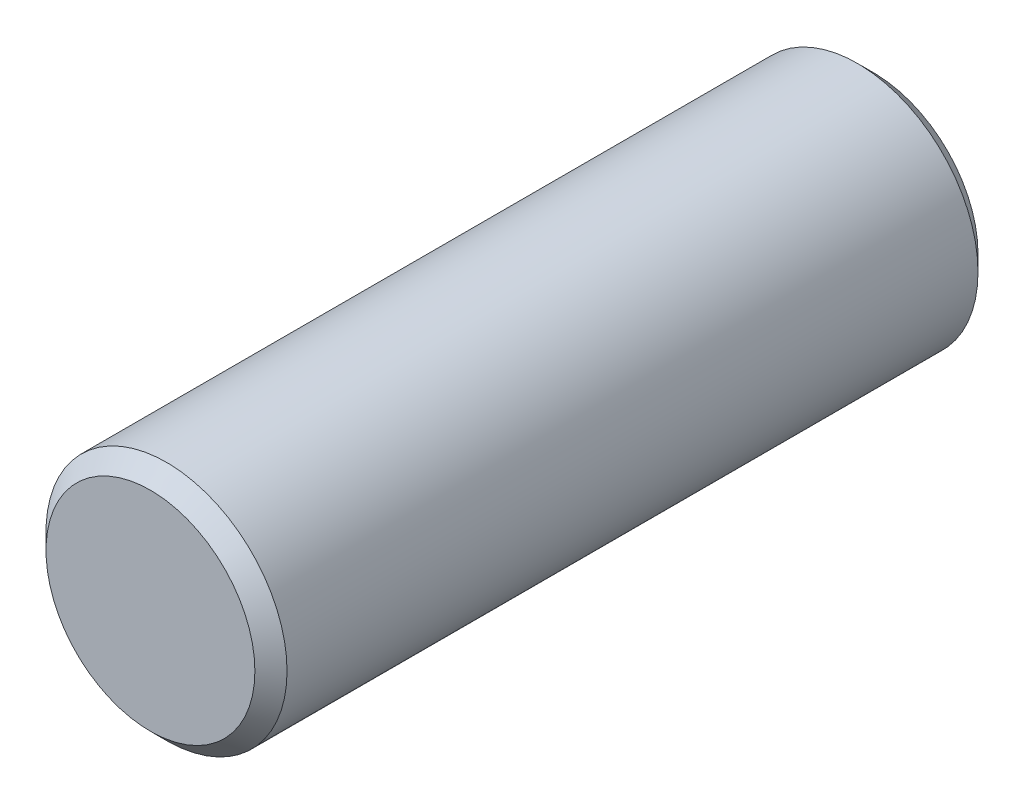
ISO-10303-21;
HEADER;
FILE_DESCRIPTION(('STEP AP214'),'2;1');
FILE_NAME('part.step','',(''),(''),'','','');
FILE_SCHEMA(('AUTOMOTIVE_DESIGN { 1 0 10303 214 1 1 1 1 }'));
ENDSEC;
DATA;
#1=APPLICATION_CONTEXT('core data for automotive mechanical design processes');
#2=APPLICATION_PROTOCOL_DEFINITION('international standard','automotive_design',2000,#1);
#3=PRODUCT_CONTEXT('',#1,'mechanical');
#4=PRODUCT('Part','Part','',(#3));
#5=PRODUCT_RELATED_PRODUCT_CATEGORY('part','',(#4));
#6=PRODUCT_DEFINITION_FORMATION('','',#4);
#7=PRODUCT_DEFINITION_CONTEXT('part definition',#1,'design');
#8=PRODUCT_DEFINITION('design','',#6,#7);
#9=PRODUCT_DEFINITION_SHAPE('','',#8);
#10=(LENGTH_UNIT() NAMED_UNIT(*) SI_UNIT(.MILLI.,.METRE.));
#11=(NAMED_UNIT(*) PLANE_ANGLE_UNIT() SI_UNIT($,.RADIAN.));
#12=(NAMED_UNIT(*) SI_UNIT($,.STERADIAN.) SOLID_ANGLE_UNIT());
#13=UNCERTAINTY_MEASURE_WITH_UNIT(LENGTH_MEASURE(1.E-05),#10,'distance_accuracy_value','');
#14=(GEOMETRIC_REPRESENTATION_CONTEXT(3) GLOBAL_UNCERTAINTY_ASSIGNED_CONTEXT((#13)) GLOBAL_UNIT_ASSIGNED_CONTEXT((#10,
#11,#12)) REPRESENTATION_CONTEXT('',''));
#15=CARTESIAN_POINT('',(0.,0.,0.));
#16=DIRECTION('',(0.,0.,1.));
#17=DIRECTION('',(1.,0.,0.));
#18=AXIS2_PLACEMENT_3D('',#15,#16,#17);
#19=CARTESIAN_POINT('',(0.,0.,9.));
#20=DIRECTION('',(0.,0.,-1.));
#21=DIRECTION('',(-1.,0.,0.));
#22=AXIS2_PLACEMENT_3D('',#19,#20,#21);
#23=CYLINDRICAL_SURFACE('',#22,1.5);
#24=CARTESIAN_POINT('',(0.,0.,0.200000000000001));
#25=DIRECTION('',(0.,0.,1.));
#26=DIRECTION('',(1.,0.,0.));
#27=AXIS2_PLACEMENT_3D('',#24,#25,#26);
#28=CIRCLE('',#27,1.5);
#29=CARTESIAN_POINT('',(1.5,0.,0.200000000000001));
#30=VERTEX_POINT('',#29);
#31=EDGE_CURVE('E42',#30,#30,#28,.T.);
#32=ORIENTED_EDGE('',*,*,#31,.T.);
#33=EDGE_LOOP('',(#32));
#34=FACE_BOUND('',#33,.T.);
#35=CARTESIAN_POINT('',(0.,0.,8.8));
#36=DIRECTION('',(0.,0.,1.));
#37=DIRECTION('',(1.,0.,0.));
#38=AXIS2_PLACEMENT_3D('',#35,#36,#37);
#39=CIRCLE('',#38,1.5);
#40=CARTESIAN_POINT('',(1.5,0.,8.8));
#41=VERTEX_POINT('',#40);
#42=EDGE_CURVE('E46',#41,#41,#39,.F.);
#43=ORIENTED_EDGE('',*,*,#42,.T.);
#44=EDGE_LOOP('',(#43));
#45=FACE_BOUND('',#44,.T.);
#46=ADVANCED_FACE('F32',(#34,#45),#23,.T.);
#47=CARTESIAN_POINT('',(0.,0.,9.));
#48=DIRECTION('',(0.,0.,1.));
#49=DIRECTION('',(1.,0.,0.));
#50=AXIS2_PLACEMENT_3D('',#47,#48,#49);
#51=PLANE('',#50);
#52=CARTESIAN_POINT('',(0.,0.,9.));
#53=DIRECTION('',(0.,0.,1.));
#54=DIRECTION('',(1.,0.,0.));
#55=AXIS2_PLACEMENT_3D('',#52,#53,#54);
#56=CIRCLE('',#55,1.3);
#57=CARTESIAN_POINT('',(1.3,0.,9.));
#58=VERTEX_POINT('',#57);
#59=EDGE_CURVE('E10',#58,#58,#56,.T.);
#60=ORIENTED_EDGE('',*,*,#59,.T.);
#61=EDGE_LOOP('',(#60));
#62=FACE_BOUND('',#61,.T.);
#63=ADVANCED_FACE('F65',(#62),#51,.T.);
#64=CARTESIAN_POINT('',(0.,0.,0.));
#65=DIRECTION('',(0.,0.,1.));
#66=DIRECTION('',(1.,0.,0.));
#67=AXIS2_PLACEMENT_3D('',#64,#65,#66);
#68=PLANE('',#67);
#69=CARTESIAN_POINT('',(0.,0.,0.));
#70=DIRECTION('',(0.,0.,1.));
#71=DIRECTION('',(1.,0.,0.));
#72=AXIS2_PLACEMENT_3D('',#69,#70,#71);
#73=CIRCLE('',#72,1.3);
#74=CARTESIAN_POINT('',(1.3,0.,0.));
#75=VERTEX_POINT('',#74);
#76=EDGE_CURVE('E38',#75,#75,#73,.F.);
#77=ORIENTED_EDGE('',*,*,#76,.T.);
#78=EDGE_LOOP('',(#77));
#79=FACE_BOUND('',#78,.T.);
#80=ADVANCED_FACE('F61',(#79),#68,.F.);
#81=CARTESIAN_POINT('',(0.,0.,0.200000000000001));
#82=DIRECTION('',(0.,0.,1.));
#83=DIRECTION('',(1.,0.,0.));
#84=AXIS2_PLACEMENT_3D('',#81,#82,#83);
#85=CONICAL_SURFACE('',#84,1.5,0.78539816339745);
#86=ORIENTED_EDGE('',*,*,#76,.F.);
#87=EDGE_LOOP('',(#86));
#88=FACE_BOUND('',#87,.T.);
#89=ORIENTED_EDGE('',*,*,#31,.F.);
#90=EDGE_LOOP('',(#89));
#91=FACE_BOUND('',#90,.T.);
#92=ADVANCED_FACE('F56',(#88,#91),#85,.T.);
#93=CARTESIAN_POINT('',(0.,0.,9.));
#94=DIRECTION('',(0.,0.,-1.));
#95=DIRECTION('',(-1.,0.,0.));
#96=AXIS2_PLACEMENT_3D('',#93,#94,#95);
#97=CONICAL_SURFACE('',#96,1.3,0.785398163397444);
#98=ORIENTED_EDGE('',*,*,#42,.F.);
#99=EDGE_LOOP('',(#98));
#100=FACE_BOUND('',#99,.T.);
#101=ORIENTED_EDGE('',*,*,#59,.F.);
#102=EDGE_LOOP('',(#101));
#103=FACE_BOUND('',#102,.T.);
#104=ADVANCED_FACE('F53',(#100,#103),#97,.T.);
#105=CLOSED_SHELL('',(#46,#63,#80,#92,#104));
#106=MANIFOLD_SOLID_BREP('B2',#105);
#107=ADVANCED_BREP_SHAPE_REPRESENTATION('',(#18,#106),#14);
#108=SHAPE_DEFINITION_REPRESENTATION(#9,#107);
ENDSEC;
END-ISO-10303-21;
